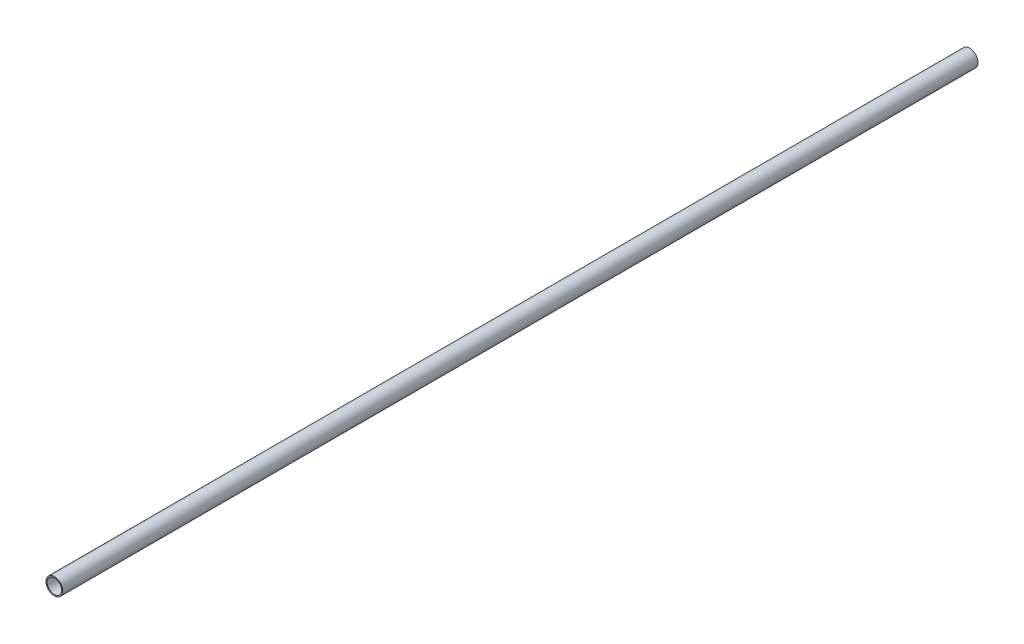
from build123d import *

# Parameters (mm, degrees)
SKETCH1_R           = 9.525
SKETCH1_R_2         = 8.255
BOSS_EXTRUDE1_DEPTH = 1041.4


with BuildPart() as part:
    # Sketch1 → Boss-Extrude1 (new body)
    with BuildSketch(Plane.XY):
        Circle(SKETCH1_R)
        Circle(SKETCH1_R_2, mode=Mode.SUBTRACT)
    extrude(amount=BOSS_EXTRUDE1_DEPTH)


solid = part.part
